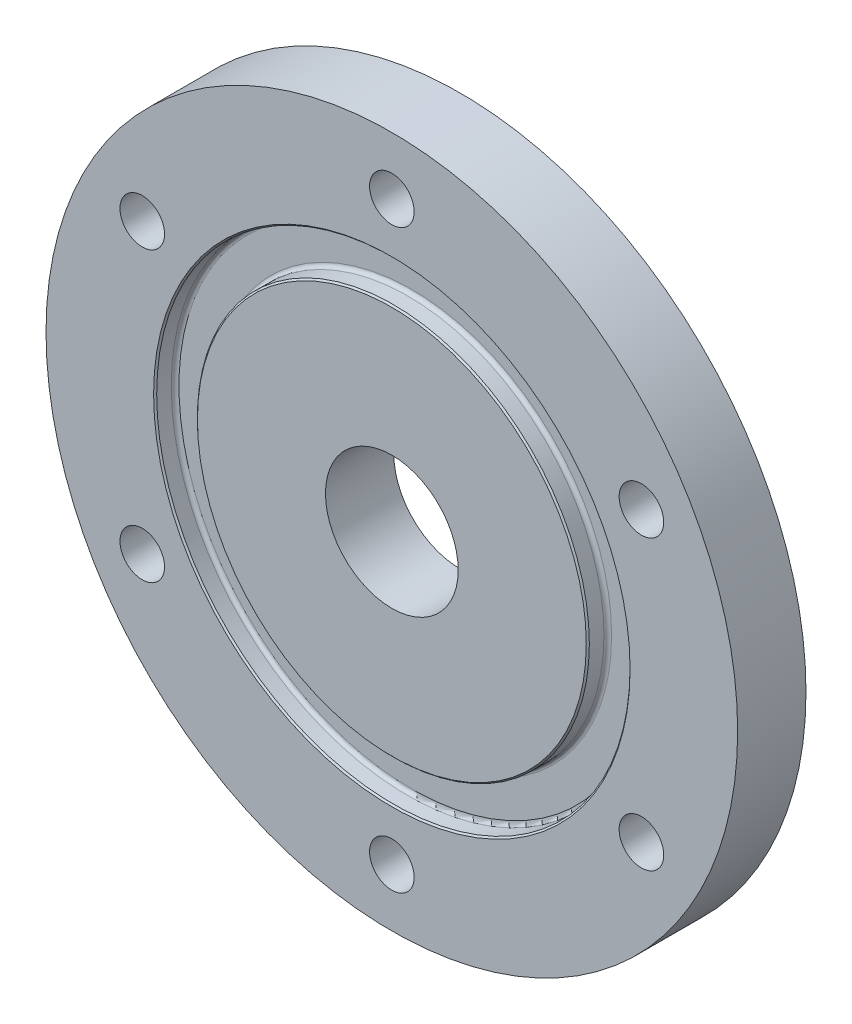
ISO-10303-21;
HEADER;
FILE_DESCRIPTION(('STEP AP214'),'2;1');
FILE_NAME('part.step','',(''),(''),'','','');
FILE_SCHEMA(('AUTOMOTIVE_DESIGN { 1 0 10303 214 1 1 1 1 }'));
ENDSEC;
DATA;
#1=APPLICATION_CONTEXT('core data for automotive mechanical design processes');
#2=APPLICATION_PROTOCOL_DEFINITION('international standard','automotive_design',2000,#1);
#3=PRODUCT_CONTEXT('',#1,'mechanical');
#4=PRODUCT('Part','Part','',(#3));
#5=PRODUCT_RELATED_PRODUCT_CATEGORY('part','',(#4));
#6=PRODUCT_DEFINITION_FORMATION('','',#4);
#7=PRODUCT_DEFINITION_CONTEXT('part definition',#1,'design');
#8=PRODUCT_DEFINITION('design','',#6,#7);
#9=PRODUCT_DEFINITION_SHAPE('','',#8);
#10=(LENGTH_UNIT() NAMED_UNIT(*) SI_UNIT(.MILLI.,.METRE.));
#11=(NAMED_UNIT(*) PLANE_ANGLE_UNIT() SI_UNIT($,.RADIAN.));
#12=(NAMED_UNIT(*) SI_UNIT($,.STERADIAN.) SOLID_ANGLE_UNIT());
#13=UNCERTAINTY_MEASURE_WITH_UNIT(LENGTH_MEASURE(1.E-05),#10,'distance_accuracy_value','');
#14=(GEOMETRIC_REPRESENTATION_CONTEXT(3) GLOBAL_UNCERTAINTY_ASSIGNED_CONTEXT((#13)) GLOBAL_UNIT_ASSIGNED_CONTEXT((#10,
#11,#12)) REPRESENTATION_CONTEXT('',''));
#15=CARTESIAN_POINT('',(0.,0.,0.));
#16=DIRECTION('',(0.,0.,1.));
#17=DIRECTION('',(1.,0.,0.));
#18=AXIS2_PLACEMENT_3D('',#15,#16,#17);
#19=CARTESIAN_POINT('',(0.,0.,8.89));
#20=DIRECTION('',(0.,0.,-1.));
#21=DIRECTION('',(-1.,0.,0.));
#22=AXIS2_PLACEMENT_3D('',#19,#20,#21);
#23=CYLINDRICAL_SURFACE('',#22,45.);
#24=CARTESIAN_POINT('',(0.,0.,8.89));
#25=DIRECTION('',(0.,0.,1.));
#26=DIRECTION('',(1.,0.,0.));
#27=AXIS2_PLACEMENT_3D('',#24,#25,#26);
#28=CIRCLE('',#27,45.);
#29=CARTESIAN_POINT('',(45.,0.,8.89));
#30=VERTEX_POINT('',#29);
#31=EDGE_CURVE('E72',#30,#30,#28,.T.);
#32=ORIENTED_EDGE('',*,*,#31,.F.);
#33=EDGE_LOOP('',(#32));
#34=FACE_BOUND('',#33,.T.);
#35=CARTESIAN_POINT('',(0.,0.,0.));
#36=DIRECTION('',(0.,0.,1.));
#37=DIRECTION('',(1.,0.,0.));
#38=AXIS2_PLACEMENT_3D('',#35,#36,#37);
#39=CIRCLE('',#38,45.);
#40=CARTESIAN_POINT('',(45.,0.,0.));
#41=VERTEX_POINT('',#40);
#42=EDGE_CURVE('E73',#41,#41,#39,.T.);
#43=ORIENTED_EDGE('',*,*,#42,.T.);
#44=EDGE_LOOP('',(#43));
#45=FACE_BOUND('',#44,.T.);
#46=ADVANCED_FACE('F39',(#34,#45),#23,.T.);
#47=CARTESIAN_POINT('',(0.,0.,8.89));
#48=DIRECTION('',(0.,0.,1.));
#49=DIRECTION('',(1.,0.,0.));
#50=AXIS2_PLACEMENT_3D('',#47,#48,#49);
#51=PLANE('',#50);
#52=CARTESIAN_POINT('',(0.,0.,8.89));
#53=DIRECTION('',(0.,0.,1.));
#54=DIRECTION('',(1.,0.,0.));
#55=AXIS2_PLACEMENT_3D('',#52,#53,#54);
#56=CIRCLE('',#55,31.);
#57=CARTESIAN_POINT('',(31.,0.,8.89));
#58=VERTEX_POINT('',#57);
#59=EDGE_CURVE('E10',#58,#58,#56,.F.);
#60=ORIENTED_EDGE('',*,*,#59,.T.);
#61=EDGE_LOOP('',(#60));
#62=FACE_BOUND('',#61,.T.);
#63=CARTESIAN_POINT('',(32.4759526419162,18.7500000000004,8.89));
#64=DIRECTION('',(0.,0.,1.));
#65=DIRECTION('',(1.,0.,0.));
#66=AXIS2_PLACEMENT_3D('',#63,#64,#65);
#67=CIRCLE('',#66,2.9);
#68=CARTESIAN_POINT('',(35.3759526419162,18.7500000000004,8.89));
#69=VERTEX_POINT('',#68);
#70=EDGE_CURVE('E111',#69,#69,#67,.T.);
#71=ORIENTED_EDGE('',*,*,#70,.F.);
#72=EDGE_LOOP('',(#71));
#73=FACE_BOUND('',#72,.T.);
#74=CARTESIAN_POINT('',(32.4759526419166,-18.7499999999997,8.89));
#75=DIRECTION('',(0.,0.,1.));
#76=DIRECTION('',(1.,0.,0.));
#77=AXIS2_PLACEMENT_3D('',#74,#75,#76);
#78=CIRCLE('',#77,2.9);
#79=CARTESIAN_POINT('',(35.3759526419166,-18.7499999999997,8.89));
#80=VERTEX_POINT('',#79);
#81=EDGE_CURVE('E105',#80,#80,#78,.T.);
#82=ORIENTED_EDGE('',*,*,#81,.F.);
#83=EDGE_LOOP('',(#82));
#84=FACE_BOUND('',#83,.T.);
#85=CARTESIAN_POINT('',(0.,-37.5,8.89));
#86=DIRECTION('',(0.,0.,1.));
#87=DIRECTION('',(1.,0.,0.));
#88=AXIS2_PLACEMENT_3D('',#85,#86,#87);
#89=CIRCLE('',#88,2.9);
#90=CARTESIAN_POINT('',(2.9,-37.5,8.89));
#91=VERTEX_POINT('',#90);
#92=EDGE_CURVE('E99',#91,#91,#89,.T.);
#93=ORIENTED_EDGE('',*,*,#92,.F.);
#94=EDGE_LOOP('',(#93));
#95=FACE_BOUND('',#94,.T.);
#96=CARTESIAN_POINT('',(-32.4759526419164,-18.7500000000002,8.89));
#97=DIRECTION('',(0.,0.,1.));
#98=DIRECTION('',(1.,0.,0.));
#99=AXIS2_PLACEMENT_3D('',#96,#97,#98);
#100=CIRCLE('',#99,2.9);
#101=CARTESIAN_POINT('',(-29.5759526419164,-18.7500000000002,8.89));
#102=VERTEX_POINT('',#101);
#103=EDGE_CURVE('E93',#102,#102,#100,.T.);
#104=ORIENTED_EDGE('',*,*,#103,.F.);
#105=EDGE_LOOP('',(#104));
#106=FACE_BOUND('',#105,.T.);
#107=CARTESIAN_POINT('',(-32.4759526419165,18.7499999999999,8.89));
#108=DIRECTION('',(0.,0.,1.));
#109=DIRECTION('',(1.,0.,0.));
#110=AXIS2_PLACEMENT_3D('',#107,#108,#109);
#111=CIRCLE('',#110,2.9);
#112=CARTESIAN_POINT('',(-29.5759526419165,18.7499999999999,8.89));
#113=VERTEX_POINT('',#112);
#114=EDGE_CURVE('E87',#113,#113,#111,.T.);
#115=ORIENTED_EDGE('',*,*,#114,.F.);
#116=EDGE_LOOP('',(#115));
#117=FACE_BOUND('',#116,.T.);
#118=CARTESIAN_POINT('',(0.,37.5,8.89));
#119=DIRECTION('',(0.,0.,1.));
#120=DIRECTION('',(1.,0.,0.));
#121=AXIS2_PLACEMENT_3D('',#118,#119,#120);
#122=CIRCLE('',#121,2.9);
#123=CARTESIAN_POINT('',(2.9,37.5,8.89));
#124=VERTEX_POINT('',#123);
#125=EDGE_CURVE('E81',#124,#124,#122,.T.);
#126=ORIENTED_EDGE('',*,*,#125,.F.);
#127=EDGE_LOOP('',(#126));
#128=FACE_BOUND('',#127,.T.);
#129=ORIENTED_EDGE('',*,*,#31,.T.);
#130=EDGE_LOOP('',(#129));
#131=FACE_BOUND('',#130,.T.);
#132=ADVANCED_FACE('F127',(#62,#73,#84,#95,#106,#117,#128,#131),#51,.T.);
#133=CARTESIAN_POINT('',(0.,0.,0.));
#134=DIRECTION('',(0.,0.,1.));
#135=DIRECTION('',(1.,0.,0.));
#136=AXIS2_PLACEMENT_3D('',#133,#134,#135);
#137=PLANE('',#136);
#138=CARTESIAN_POINT('',(0.,0.,0.));
#139=DIRECTION('',(0.,0.,-1.));
#140=DIRECTION('',(-1.,0.,0.));
#141=AXIS2_PLACEMENT_3D('',#138,#139,#140);
#142=CIRCLE('',#141,8.636);
#143=CARTESIAN_POINT('',(-8.636,0.,0.));
#144=VERTEX_POINT('',#143);
#145=EDGE_CURVE('E114',#144,#144,#142,.T.);
#146=ORIENTED_EDGE('',*,*,#145,.F.);
#147=EDGE_LOOP('',(#146));
#148=FACE_BOUND('',#147,.T.);
#149=CARTESIAN_POINT('',(32.4759526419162,18.7500000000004,0.));
#150=DIRECTION('',(0.,0.,1.));
#151=DIRECTION('',(1.,0.,0.));
#152=AXIS2_PLACEMENT_3D('',#149,#150,#151);
#153=CIRCLE('',#152,2.9);
#154=CARTESIAN_POINT('',(35.3759526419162,18.7500000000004,0.));
#155=VERTEX_POINT('',#154);
#156=EDGE_CURVE('E108',#155,#155,#153,.T.);
#157=ORIENTED_EDGE('',*,*,#156,.T.);
#158=EDGE_LOOP('',(#157));
#159=FACE_BOUND('',#158,.T.);
#160=CARTESIAN_POINT('',(32.4759526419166,-18.7499999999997,0.));
#161=DIRECTION('',(0.,0.,1.));
#162=DIRECTION('',(1.,0.,0.));
#163=AXIS2_PLACEMENT_3D('',#160,#161,#162);
#164=CIRCLE('',#163,2.9);
#165=CARTESIAN_POINT('',(35.3759526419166,-18.7499999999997,0.));
#166=VERTEX_POINT('',#165);
#167=EDGE_CURVE('E102',#166,#166,#164,.T.);
#168=ORIENTED_EDGE('',*,*,#167,.T.);
#169=EDGE_LOOP('',(#168));
#170=FACE_BOUND('',#169,.T.);
#171=CARTESIAN_POINT('',(0.,-37.5,0.));
#172=DIRECTION('',(0.,0.,1.));
#173=DIRECTION('',(1.,0.,0.));
#174=AXIS2_PLACEMENT_3D('',#171,#172,#173);
#175=CIRCLE('',#174,2.9);
#176=CARTESIAN_POINT('',(2.9,-37.5,0.));
#177=VERTEX_POINT('',#176);
#178=EDGE_CURVE('E96',#177,#177,#175,.T.);
#179=ORIENTED_EDGE('',*,*,#178,.T.);
#180=EDGE_LOOP('',(#179));
#181=FACE_BOUND('',#180,.T.);
#182=CARTESIAN_POINT('',(-32.4759526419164,-18.7500000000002,0.));
#183=DIRECTION('',(0.,0.,1.));
#184=DIRECTION('',(1.,0.,0.));
#185=AXIS2_PLACEMENT_3D('',#182,#183,#184);
#186=CIRCLE('',#185,2.9);
#187=CARTESIAN_POINT('',(-29.5759526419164,-18.7500000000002,0.));
#188=VERTEX_POINT('',#187);
#189=EDGE_CURVE('E90',#188,#188,#186,.T.);
#190=ORIENTED_EDGE('',*,*,#189,.T.);
#191=EDGE_LOOP('',(#190));
#192=FACE_BOUND('',#191,.T.);
#193=CARTESIAN_POINT('',(-32.4759526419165,18.7499999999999,0.));
#194=DIRECTION('',(0.,0.,1.));
#195=DIRECTION('',(1.,0.,0.));
#196=AXIS2_PLACEMENT_3D('',#193,#194,#195);
#197=CIRCLE('',#196,2.9);
#198=CARTESIAN_POINT('',(-29.5759526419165,18.7499999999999,0.));
#199=VERTEX_POINT('',#198);
#200=EDGE_CURVE('E84',#199,#199,#197,.T.);
#201=ORIENTED_EDGE('',*,*,#200,.T.);
#202=EDGE_LOOP('',(#201));
#203=FACE_BOUND('',#202,.T.);
#204=CARTESIAN_POINT('',(0.,37.5,0.));
#205=DIRECTION('',(0.,0.,1.));
#206=DIRECTION('',(1.,0.,0.));
#207=AXIS2_PLACEMENT_3D('',#204,#205,#206);
#208=CIRCLE('',#207,2.9);
#209=CARTESIAN_POINT('',(2.9,37.5,0.));
#210=VERTEX_POINT('',#209);
#211=EDGE_CURVE('E76',#210,#210,#208,.T.);
#212=ORIENTED_EDGE('',*,*,#211,.T.);
#213=EDGE_LOOP('',(#212));
#214=FACE_BOUND('',#213,.T.);
#215=ORIENTED_EDGE('',*,*,#42,.F.);
#216=EDGE_LOOP('',(#215));
#217=FACE_BOUND('',#216,.T.);
#218=ADVANCED_FACE('F123',(#148,#159,#170,#181,#192,#203,#214,#217),#137,.F.);
#219=CARTESIAN_POINT('',(0.,0.,6.29));
#220=DIRECTION('',(0.,0.,1.));
#221=DIRECTION('',(1.,0.,0.));
#222=AXIS2_PLACEMENT_3D('',#219,#220,#221);
#223=CYLINDRICAL_SURFACE('',#222,25.5);
#224=CARTESIAN_POINT('',(0.,0.,8.69000000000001));
#225=DIRECTION('',(0.,0.,1.));
#226=DIRECTION('',(1.,0.,0.));
#227=AXIS2_PLACEMENT_3D('',#224,#225,#226);
#228=CIRCLE('',#227,25.5);
#229=CARTESIAN_POINT('',(25.5,0.,8.69000000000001));
#230=VERTEX_POINT('',#229);
#231=EDGE_CURVE('E51',#230,#230,#228,.F.);
#232=ORIENTED_EDGE('',*,*,#231,.T.);
#233=EDGE_LOOP('',(#232));
#234=FACE_BOUND('',#233,.T.);
#235=CARTESIAN_POINT('',(0.,0.,6.79));
#236=DIRECTION('',(0.,0.,1.));
#237=DIRECTION('',(1.,0.,0.));
#238=AXIS2_PLACEMENT_3D('',#235,#236,#237);
#239=CIRCLE('',#238,25.5);
#240=CARTESIAN_POINT('',(25.5,0.,6.79));
#241=VERTEX_POINT('',#240);
#242=EDGE_CURVE('E69',#241,#241,#239,.T.);
#243=ORIENTED_EDGE('',*,*,#242,.T.);
#244=EDGE_LOOP('',(#243));
#245=FACE_BOUND('',#244,.T.);
#246=ADVANCED_FACE('F126',(#234,#245),#223,.T.);
#247=CARTESIAN_POINT('',(0.,0.,6.29));
#248=DIRECTION('',(0.,0.,1.));
#249=DIRECTION('',(1.,0.,0.));
#250=AXIS2_PLACEMENT_3D('',#247,#248,#249);
#251=CYLINDRICAL_SURFACE('',#250,30.8);
#252=CARTESIAN_POINT('',(0.,0.,8.68999999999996));
#253=DIRECTION('',(0.,0.,1.));
#254=DIRECTION('',(1.,0.,0.));
#255=AXIS2_PLACEMENT_3D('',#252,#253,#254);
#256=CIRCLE('',#255,30.8);
#257=CARTESIAN_POINT('',(30.8,0.,8.68999999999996));
#258=VERTEX_POINT('',#257);
#259=EDGE_CURVE('E47',#258,#258,#256,.T.);
#260=ORIENTED_EDGE('',*,*,#259,.T.);
#261=EDGE_LOOP('',(#260));
#262=FACE_BOUND('',#261,.T.);
#263=CARTESIAN_POINT('',(0.,0.,6.79));
#264=DIRECTION('',(0.,0.,1.));
#265=DIRECTION('',(1.,0.,0.));
#266=AXIS2_PLACEMENT_3D('',#263,#264,#265);
#267=CIRCLE('',#266,30.8);
#268=CARTESIAN_POINT('',(30.8,0.,6.79));
#269=VERTEX_POINT('',#268);
#270=EDGE_CURVE('E60',#269,#269,#267,.F.);
#271=ORIENTED_EDGE('',*,*,#270,.T.);
#272=EDGE_LOOP('',(#271));
#273=FACE_BOUND('',#272,.T.);
#274=ADVANCED_FACE('F188',(#262,#273),#251,.F.);
#275=CARTESIAN_POINT('',(0.,0.,6.29));
#276=DIRECTION('',(0.,0.,1.));
#277=DIRECTION('',(1.,0.,0.));
#278=AXIS2_PLACEMENT_3D('',#275,#276,#277);
#279=PLANE('',#278);
#280=CARTESIAN_POINT('',(0.,0.,6.29));
#281=DIRECTION('',(0.,0.,1.));
#282=DIRECTION('',(1.,0.,0.));
#283=AXIS2_PLACEMENT_3D('',#280,#281,#282);
#284=CIRCLE('',#283,26.);
#285=CARTESIAN_POINT('',(26.,0.,6.29));
#286=VERTEX_POINT('',#285);
#287=EDGE_CURVE('E63',#286,#286,#284,.F.);
#288=ORIENTED_EDGE('',*,*,#287,.T.);
#289=EDGE_LOOP('',(#288));
#290=FACE_BOUND('',#289,.T.);
#291=CARTESIAN_POINT('',(0.,0.,6.29));
#292=DIRECTION('',(0.,0.,1.));
#293=DIRECTION('',(1.,0.,0.));
#294=AXIS2_PLACEMENT_3D('',#291,#292,#293);
#295=CIRCLE('',#294,30.3);
#296=CARTESIAN_POINT('',(30.3,0.,6.29));
#297=VERTEX_POINT('',#296);
#298=EDGE_CURVE('E66',#297,#297,#295,.T.);
#299=ORIENTED_EDGE('',*,*,#298,.T.);
#300=EDGE_LOOP('',(#299));
#301=FACE_BOUND('',#300,.T.);
#302=ADVANCED_FACE('F179',(#290,#301),#279,.T.);
#303=CARTESIAN_POINT('',(0.,0.,8.89));
#304=DIRECTION('',(0.,0.,1.));
#305=DIRECTION('',(1.,0.,0.));
#306=AXIS2_PLACEMENT_3D('',#303,#304,#305);
#307=CIRCLE('',#306,8.636);
#308=CARTESIAN_POINT('',(8.636,0.,8.89));
#309=VERTEX_POINT('',#308);
#310=EDGE_CURVE('E115',#309,#309,#307,.F.);
#311=ORIENTED_EDGE('',*,*,#310,.T.);
#312=EDGE_LOOP('',(#311));
#313=FACE_BOUND('',#312,.T.);
#314=CARTESIAN_POINT('',(0.,0.,8.89));
#315=DIRECTION('',(0.,0.,1.));
#316=DIRECTION('',(1.,0.,0.));
#317=AXIS2_PLACEMENT_3D('',#314,#315,#316);
#318=CIRCLE('',#317,25.3);
#319=CARTESIAN_POINT('',(25.3,0.,8.89));
#320=VERTEX_POINT('',#319);
#321=EDGE_CURVE('E55',#320,#320,#318,.T.);
#322=ORIENTED_EDGE('',*,*,#321,.T.);
#323=EDGE_LOOP('',(#322));
#324=FACE_BOUND('',#323,.T.);
#325=ADVANCED_FACE('F151',(#313,#324),#51,.T.);
#326=CARTESIAN_POINT('',(0.,37.5,8.89));
#327=DIRECTION('',(0.,0.,1.));
#328=DIRECTION('',(1.,0.,0.));
#329=AXIS2_PLACEMENT_3D('',#326,#327,#328);
#330=CYLINDRICAL_SURFACE('',#329,2.9);
#331=ORIENTED_EDGE('',*,*,#211,.F.);
#332=EDGE_LOOP('',(#331));
#333=FACE_BOUND('',#332,.T.);
#334=ORIENTED_EDGE('',*,*,#125,.T.);
#335=EDGE_LOOP('',(#334));
#336=FACE_BOUND('',#335,.T.);
#337=ADVANCED_FACE('F178',(#333,#336),#330,.F.);
#338=CARTESIAN_POINT('',(-32.4759526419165,18.7499999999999,8.89));
#339=DIRECTION('',(0.,0.,1.));
#340=DIRECTION('',(1.,0.,0.));
#341=AXIS2_PLACEMENT_3D('',#338,#339,#340);
#342=CYLINDRICAL_SURFACE('',#341,2.9);
#343=ORIENTED_EDGE('',*,*,#200,.F.);
#344=EDGE_LOOP('',(#343));
#345=FACE_BOUND('',#344,.T.);
#346=ORIENTED_EDGE('',*,*,#114,.T.);
#347=EDGE_LOOP('',(#346));
#348=FACE_BOUND('',#347,.T.);
#349=ADVANCED_FACE('F184',(#345,#348),#342,.F.);
#350=CARTESIAN_POINT('',(-32.4759526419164,-18.7500000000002,8.89));
#351=DIRECTION('',(0.,0.,1.));
#352=DIRECTION('',(1.,0.,0.));
#353=AXIS2_PLACEMENT_3D('',#350,#351,#352);
#354=CYLINDRICAL_SURFACE('',#353,2.9);
#355=ORIENTED_EDGE('',*,*,#189,.F.);
#356=EDGE_LOOP('',(#355));
#357=FACE_BOUND('',#356,.T.);
#358=ORIENTED_EDGE('',*,*,#103,.T.);
#359=EDGE_LOOP('',(#358));
#360=FACE_BOUND('',#359,.T.);
#361=ADVANCED_FACE('F198',(#357,#360),#354,.F.);
#362=CARTESIAN_POINT('',(0.,-37.5,8.89));
#363=DIRECTION('',(0.,0.,1.));
#364=DIRECTION('',(1.,0.,0.));
#365=AXIS2_PLACEMENT_3D('',#362,#363,#364);
#366=CYLINDRICAL_SURFACE('',#365,2.9);
#367=ORIENTED_EDGE('',*,*,#178,.F.);
#368=EDGE_LOOP('',(#367));
#369=FACE_BOUND('',#368,.T.);
#370=ORIENTED_EDGE('',*,*,#92,.T.);
#371=EDGE_LOOP('',(#370));
#372=FACE_BOUND('',#371,.T.);
#373=ADVANCED_FACE('F202',(#369,#372),#366,.F.);
#374=CARTESIAN_POINT('',(32.4759526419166,-18.7499999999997,8.89));
#375=DIRECTION('',(0.,0.,1.));
#376=DIRECTION('',(1.,0.,0.));
#377=AXIS2_PLACEMENT_3D('',#374,#375,#376);
#378=CYLINDRICAL_SURFACE('',#377,2.9);
#379=ORIENTED_EDGE('',*,*,#167,.F.);
#380=EDGE_LOOP('',(#379));
#381=FACE_BOUND('',#380,.T.);
#382=ORIENTED_EDGE('',*,*,#81,.T.);
#383=EDGE_LOOP('',(#382));
#384=FACE_BOUND('',#383,.T.);
#385=ADVANCED_FACE('F206',(#381,#384),#378,.F.);
#386=CARTESIAN_POINT('',(32.4759526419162,18.7500000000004,8.89));
#387=DIRECTION('',(0.,0.,1.));
#388=DIRECTION('',(1.,0.,0.));
#389=AXIS2_PLACEMENT_3D('',#386,#387,#388);
#390=CYLINDRICAL_SURFACE('',#389,2.9);
#391=ORIENTED_EDGE('',*,*,#156,.F.);
#392=EDGE_LOOP('',(#391));
#393=FACE_BOUND('',#392,.T.);
#394=ORIENTED_EDGE('',*,*,#70,.T.);
#395=EDGE_LOOP('',(#394));
#396=FACE_BOUND('',#395,.T.);
#397=ADVANCED_FACE('F158',(#393,#396),#390,.F.);
#398=CARTESIAN_POINT('',(0.,0.,6.79));
#399=DIRECTION('',(0.,0.,1.));
#400=DIRECTION('',(1.,0.,0.));
#401=AXIS2_PLACEMENT_3D('',#398,#399,#400);
#402=TOROIDAL_SURFACE('',#401,26.,0.5);
#403=ORIENTED_EDGE('',*,*,#287,.F.);
#404=EDGE_LOOP('',(#403));
#405=FACE_BOUND('',#404,.T.);
#406=ORIENTED_EDGE('',*,*,#242,.F.);
#407=EDGE_LOOP('',(#406));
#408=FACE_BOUND('',#407,.T.);
#409=ADVANCED_FACE('F154',(#405,#408),#402,.F.);
#410=CARTESIAN_POINT('',(0.,0.,6.79));
#411=DIRECTION('',(0.,0.,1.));
#412=DIRECTION('',(1.,0.,0.));
#413=AXIS2_PLACEMENT_3D('',#410,#411,#412);
#414=TOROIDAL_SURFACE('',#413,30.3,0.5);
#415=ORIENTED_EDGE('',*,*,#270,.F.);
#416=EDGE_LOOP('',(#415));
#417=FACE_BOUND('',#416,.T.);
#418=ORIENTED_EDGE('',*,*,#298,.F.);
#419=EDGE_LOOP('',(#418));
#420=FACE_BOUND('',#419,.T.);
#421=ADVANCED_FACE('F157',(#417,#420),#414,.F.);
#422=CARTESIAN_POINT('',(0.,0.,8.89));
#423=DIRECTION('',(0.,0.,-1.));
#424=DIRECTION('',(-1.,0.,0.));
#425=AXIS2_PLACEMENT_3D('',#422,#423,#424);
#426=CONICAL_SURFACE('',#425,25.3,0.785398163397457);
#427=ORIENTED_EDGE('',*,*,#231,.F.);
#428=EDGE_LOOP('',(#427));
#429=FACE_BOUND('',#428,.T.);
#430=ORIENTED_EDGE('',*,*,#321,.F.);
#431=EDGE_LOOP('',(#430));
#432=FACE_BOUND('',#431,.T.);
#433=ADVANCED_FACE('F161',(#429,#432),#426,.T.);
#434=CARTESIAN_POINT('',(0.,0.,8.68999999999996));
#435=DIRECTION('',(0.,0.,1.));
#436=DIRECTION('',(1.,0.,0.));
#437=AXIS2_PLACEMENT_3D('',#434,#435,#436);
#438=CONICAL_SURFACE('',#437,30.8,0.785398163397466);
#439=ORIENTED_EDGE('',*,*,#59,.F.);
#440=EDGE_LOOP('',(#439));
#441=FACE_BOUND('',#440,.T.);
#442=ORIENTED_EDGE('',*,*,#259,.F.);
#443=EDGE_LOOP('',(#442));
#444=FACE_BOUND('',#443,.T.);
#445=ADVANCED_FACE('F42',(#441,#444),#438,.F.);
#446=CARTESIAN_POINT('',(0.,0.,8.891));
#447=DIRECTION('',(0.,0.,-1.));
#448=DIRECTION('',(-1.,0.,0.));
#449=AXIS2_PLACEMENT_3D('',#446,#447,#448);
#450=CYLINDRICAL_SURFACE('',#449,8.636);
#451=ORIENTED_EDGE('',*,*,#310,.F.);
#452=EDGE_LOOP('',(#451));
#453=FACE_BOUND('',#452,.T.);
#454=ORIENTED_EDGE('',*,*,#145,.T.);
#455=EDGE_LOOP('',(#454));
#456=FACE_BOUND('',#455,.T.);
#457=ADVANCED_FACE('F121',(#453,#456),#450,.F.);
#458=CLOSED_SHELL('',(#46,#132,#218,#246,#274,#302,#325,#337,#349,#361,#373,#385,#397,#409,#421,
#433,#445,#457));
#459=MANIFOLD_SOLID_BREP('B2',#458);
#460=ADVANCED_BREP_SHAPE_REPRESENTATION('',(#18,#459),#14);
#461=SHAPE_DEFINITION_REPRESENTATION(#9,#460);
ENDSEC;
END-ISO-10303-21;
